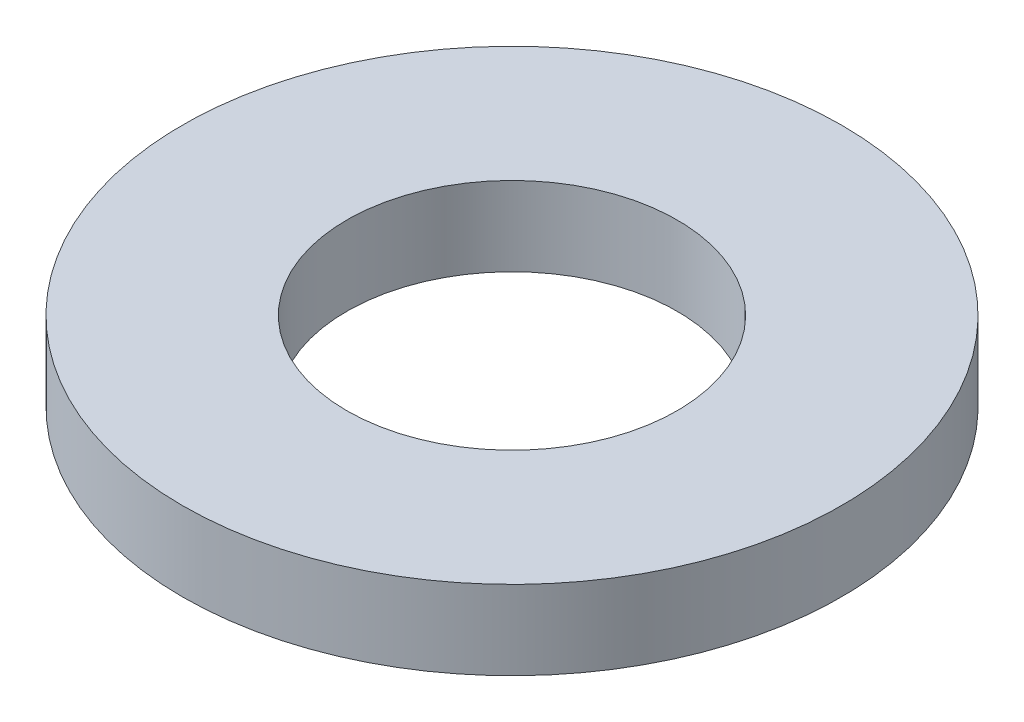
ISO-10303-21;
HEADER;
FILE_DESCRIPTION(('STEP AP214'),'2;1');
FILE_NAME('part.step','',(''),(''),'','','');
FILE_SCHEMA(('AUTOMOTIVE_DESIGN { 1 0 10303 214 1 1 1 1 }'));
ENDSEC;
DATA;
#1=APPLICATION_CONTEXT('core data for automotive mechanical design processes');
#2=APPLICATION_PROTOCOL_DEFINITION('international standard','automotive_design',2000,#1);
#3=PRODUCT_CONTEXT('',#1,'mechanical');
#4=PRODUCT('Part','Part','',(#3));
#5=PRODUCT_RELATED_PRODUCT_CATEGORY('part','',(#4));
#6=PRODUCT_DEFINITION_FORMATION('','',#4);
#7=PRODUCT_DEFINITION_CONTEXT('part definition',#1,'design');
#8=PRODUCT_DEFINITION('design','',#6,#7);
#9=PRODUCT_DEFINITION_SHAPE('','',#8);
#10=(LENGTH_UNIT() NAMED_UNIT(*) SI_UNIT(.MILLI.,.METRE.));
#11=(NAMED_UNIT(*) PLANE_ANGLE_UNIT() SI_UNIT($,.RADIAN.));
#12=(NAMED_UNIT(*) SI_UNIT($,.STERADIAN.) SOLID_ANGLE_UNIT());
#13=UNCERTAINTY_MEASURE_WITH_UNIT(LENGTH_MEASURE(1.E-05),#10,'distance_accuracy_value','');
#14=(GEOMETRIC_REPRESENTATION_CONTEXT(3) GLOBAL_UNCERTAINTY_ASSIGNED_CONTEXT((#13)) GLOBAL_UNIT_ASSIGNED_CONTEXT((#10,
#11,#12)) REPRESENTATION_CONTEXT('',''));
#15=CARTESIAN_POINT('',(0.,0.,0.));
#16=DIRECTION('',(0.,0.,1.));
#17=DIRECTION('',(1.,0.,0.));
#18=AXIS2_PLACEMENT_3D('',#15,#16,#17);
#19=CARTESIAN_POINT('',(0.,1.143,0.));
#20=DIRECTION('',(0.,1.,0.));
#21=DIRECTION('',(0.,0.,1.));
#22=AXIS2_PLACEMENT_3D('',#19,#20,#21);
#23=PLANE('',#22);
#24=CARTESIAN_POINT('',(0.,1.143,0.));
#25=DIRECTION('',(0.,1.,0.));
#26=DIRECTION('',(0.,0.,1.));
#27=AXIS2_PLACEMENT_3D('',#24,#25,#26);
#28=CIRCLE('',#27,4.7625);
#29=CARTESIAN_POINT('',(0.,1.143,4.7625));
#30=VERTEX_POINT('',#29);
#31=EDGE_CURVE('E10',#30,#30,#28,.T.);
#32=ORIENTED_EDGE('',*,*,#31,.T.);
#33=EDGE_LOOP('',(#32));
#34=FACE_BOUND('',#33,.T.);
#35=CARTESIAN_POINT('',(0.,1.143,0.));
#36=DIRECTION('',(0.,1.,0.));
#37=DIRECTION('',(0.,0.,1.));
#38=AXIS2_PLACEMENT_3D('',#35,#36,#37);
#39=CIRCLE('',#38,2.3876);
#40=CARTESIAN_POINT('',(0.,1.143,2.3876));
#41=VERTEX_POINT('',#40);
#42=EDGE_CURVE('E390',#41,#41,#39,.T.);
#43=ORIENTED_EDGE('',*,*,#42,.F.);
#44=EDGE_LOOP('',(#43));
#45=FACE_BOUND('',#44,.T.);
#46=ADVANCED_FACE('F379',(#34,#45),#23,.T.);
#47=CARTESIAN_POINT('',(0.,0.,0.));
#48=DIRECTION('',(0.,1.,0.));
#49=DIRECTION('',(0.,0.,1.));
#50=AXIS2_PLACEMENT_3D('',#47,#48,#49);
#51=PLANE('',#50);
#52=CARTESIAN_POINT('',(0.,0.,0.));
#53=DIRECTION('',(0.,1.,0.));
#54=DIRECTION('',(0.,0.,1.));
#55=AXIS2_PLACEMENT_3D('',#52,#53,#54);
#56=CIRCLE('',#55,4.7625);
#57=CARTESIAN_POINT('',(0.,0.,4.7625));
#58=VERTEX_POINT('',#57);
#59=EDGE_CURVE('E386',#58,#58,#56,.T.);
#60=ORIENTED_EDGE('',*,*,#59,.F.);
#61=EDGE_LOOP('',(#60));
#62=FACE_BOUND('',#61,.T.);
#63=CARTESIAN_POINT('',(0.,0.,0.));
#64=DIRECTION('',(0.,1.,0.));
#65=DIRECTION('',(0.,0.,1.));
#66=AXIS2_PLACEMENT_3D('',#63,#64,#65);
#67=CIRCLE('',#66,2.3876);
#68=CARTESIAN_POINT('',(0.,0.,2.3876));
#69=VERTEX_POINT('',#68);
#70=EDGE_CURVE('E394',#69,#69,#67,.T.);
#71=ORIENTED_EDGE('',*,*,#70,.T.);
#72=EDGE_LOOP('',(#71));
#73=FACE_BOUND('',#72,.T.);
#74=ADVANCED_FACE('F400',(#62,#73),#51,.F.);
#75=CARTESIAN_POINT('',(0.,1.143,0.));
#76=DIRECTION('',(0.,-1.,0.));
#77=DIRECTION('',(0.,0.,-1.));
#78=AXIS2_PLACEMENT_3D('',#75,#76,#77);
#79=CYLINDRICAL_SURFACE('',#78,4.7625);
#80=ORIENTED_EDGE('',*,*,#31,.F.);
#81=EDGE_LOOP('',(#80));
#82=FACE_BOUND('',#81,.T.);
#83=ORIENTED_EDGE('',*,*,#59,.T.);
#84=EDGE_LOOP('',(#83));
#85=FACE_BOUND('',#84,.T.);
#86=ADVANCED_FACE('F381',(#82,#85),#79,.T.);
#87=CARTESIAN_POINT('',(0.,1.143,0.));
#88=DIRECTION('',(0.,-1.,0.));
#89=DIRECTION('',(0.,0.,-1.));
#90=AXIS2_PLACEMENT_3D('',#87,#88,#89);
#91=CYLINDRICAL_SURFACE('',#90,2.3876);
#92=ORIENTED_EDGE('',*,*,#42,.T.);
#93=EDGE_LOOP('',(#92));
#94=FACE_BOUND('',#93,.T.);
#95=ORIENTED_EDGE('',*,*,#70,.F.);
#96=EDGE_LOOP('',(#95));
#97=FACE_BOUND('',#96,.T.);
#98=ADVANCED_FACE('F402',(#94,#97),#91,.F.);
#99=CLOSED_SHELL('',(#46,#74,#86,#98));
#100=MANIFOLD_SOLID_BREP('B2',#99);
#101=ADVANCED_BREP_SHAPE_REPRESENTATION('',(#18,#100),#14);
#102=SHAPE_DEFINITION_REPRESENTATION(#9,#101);
ENDSEC;
END-ISO-10303-21;
